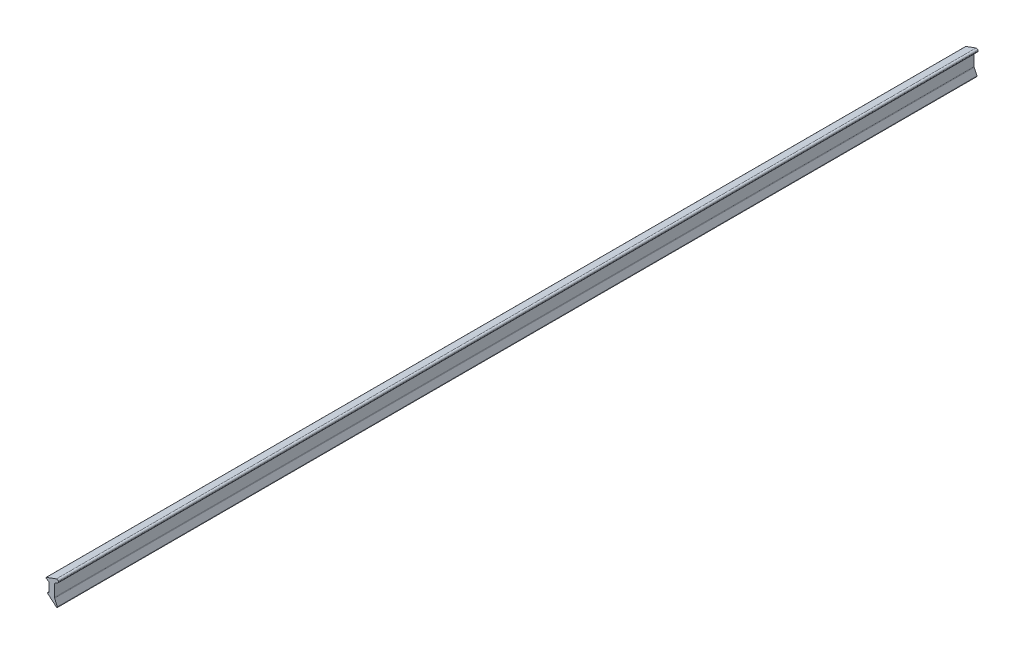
from build123d import *

# Parameters (mm, degrees)
EXTRUDE_1_DEPTH = 150
FILLET_1_R      = 0.5
FILLET_2_R      = 0.2


with BuildPart() as part:
    # Sketch 1 → Extrude 1 (new, symmetric)
    with BuildSketch(Plane.XY):
        Polygon((0, 0), (0, 3), (-1.309812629, 3.731020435), (2.918804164, 5.27011108), (3.066354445, 4.281056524), (1.735759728, 3.50918955), (1.735759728, -0.599119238), (3.063380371, -3.485494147), (-0.756728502, -0.259541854), align=None)
    extrude(amount=EXTRUDE_1_DEPTH, both=True)

    # Fillet 1
    fillet_1_edges = [part.edges().sort_by_distance(p)[0] for p in [
        (2.918804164, 5.27011108, 0),
        (3.066354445, 4.281056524, 0),
        (1.735759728, -0.599119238, 0),
    ]]
    fillet(fillet_1_edges, radius=FILLET_1_R)

    # Fillet 2
    fillet_2_edges = [part.edges().sort_by_distance(p)[0] for p in [
        (-1.309812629, 3.731020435, 0),
        (3.063380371, -3.485494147, 0),
        (-0.756728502, -0.259541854, 0),
    ]]
    fillet(fillet_2_edges, radius=FILLET_2_R)


solid = part.part
